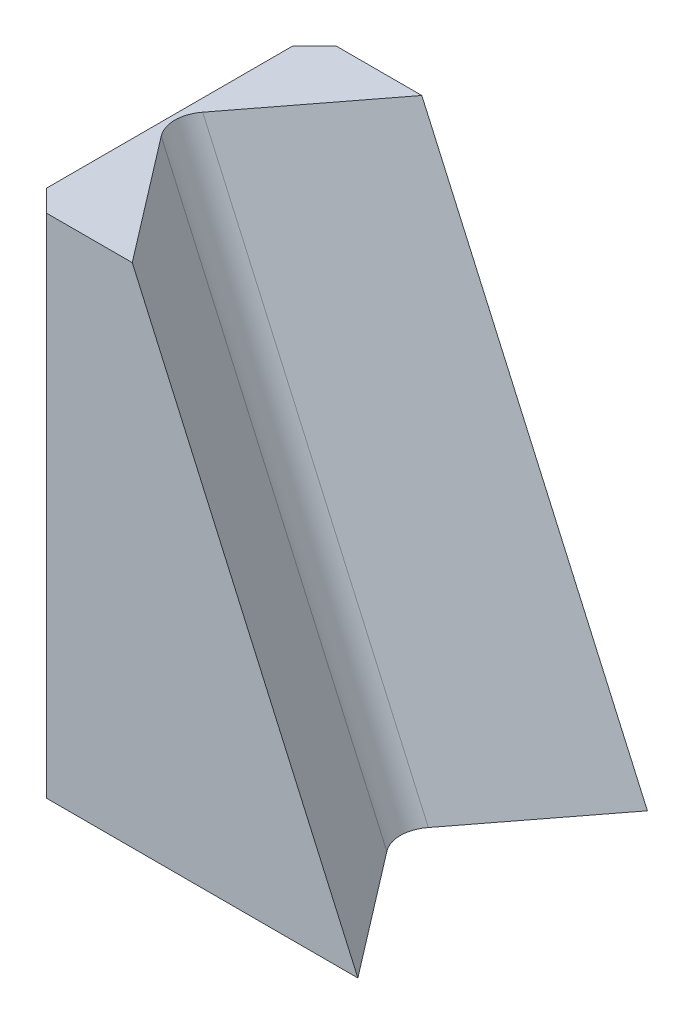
ISO-10303-21;
HEADER;
FILE_DESCRIPTION(('STEP AP214'),'2;1');
FILE_NAME('part.step','',(''),(''),'','','');
FILE_SCHEMA(('AUTOMOTIVE_DESIGN { 1 0 10303 214 1 1 1 1 }'));
ENDSEC;
DATA;
#1=APPLICATION_CONTEXT('core data for automotive mechanical design processes');
#2=APPLICATION_PROTOCOL_DEFINITION('international standard','automotive_design',2000,#1);
#3=PRODUCT_CONTEXT('',#1,'mechanical');
#4=PRODUCT('Part','Part','',(#3));
#5=PRODUCT_RELATED_PRODUCT_CATEGORY('part','',(#4));
#6=PRODUCT_DEFINITION_FORMATION('','',#4);
#7=PRODUCT_DEFINITION_CONTEXT('part definition',#1,'design');
#8=PRODUCT_DEFINITION('design','',#6,#7);
#9=PRODUCT_DEFINITION_SHAPE('','',#8);
#10=(LENGTH_UNIT() NAMED_UNIT(*) SI_UNIT(.MILLI.,.METRE.));
#11=(NAMED_UNIT(*) PLANE_ANGLE_UNIT() SI_UNIT($,.RADIAN.));
#12=(NAMED_UNIT(*) SI_UNIT($,.STERADIAN.) SOLID_ANGLE_UNIT());
#13=UNCERTAINTY_MEASURE_WITH_UNIT(LENGTH_MEASURE(1.E-05),#10,'distance_accuracy_value','');
#14=(GEOMETRIC_REPRESENTATION_CONTEXT(3) GLOBAL_UNCERTAINTY_ASSIGNED_CONTEXT((#13)) GLOBAL_UNIT_ASSIGNED_CONTEXT((#10,
#11,#12)) REPRESENTATION_CONTEXT('',''));
#15=CARTESIAN_POINT('',(0.,0.,0.));
#16=DIRECTION('',(0.,0.,1.));
#17=DIRECTION('',(1.,0.,0.));
#18=AXIS2_PLACEMENT_3D('',#15,#16,#17);
#19=CARTESIAN_POINT('',(1.48339920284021,7.,4.));
#20=DIRECTION('',(0.,-1.,0.));
#21=DIRECTION('',(0.,0.,-1.));
#22=AXIS2_PLACEMENT_3D('',#19,#20,#21);
#23=PLANE('',#22);
#24=DIRECTION('',(-1.,0.,0.));
#25=VECTOR('',#24,1.);
#26=CARTESIAN_POINT('',(1.48339920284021,7.,0.));
#27=LINE('',#26,#25);
#28=CARTESIAN_POINT('',(1.48339920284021,7.,0.));
#29=VERTEX_POINT('',#28);
#30=CARTESIAN_POINT('',(0.3,7.,0.));
#31=VERTEX_POINT('',#30);
#32=EDGE_CURVE('E130',#29,#31,#27,.T.);
#33=ORIENTED_EDGE('',*,*,#32,.T.);
#34=DIRECTION('',(0.70710678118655,0.,-0.707106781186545));
#35=VECTOR('',#34,1.);
#36=CARTESIAN_POINT('',(0.,7.,0.299999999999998));
#37=LINE('',#36,#35);
#38=CARTESIAN_POINT('',(0.,7.,0.299999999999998));
#39=VERTEX_POINT('',#38);
#40=EDGE_CURVE('E56',#31,#39,#37,.F.);
#41=ORIENTED_EDGE('',*,*,#40,.T.);
#42=DIRECTION('',(0.,0.,-1.));
#43=VECTOR('',#42,1.);
#44=CARTESIAN_POINT('',(0.,7.,4.));
#45=LINE('',#44,#43);
#46=CARTESIAN_POINT('',(0.,7.,3.7));
#47=VERTEX_POINT('',#46);
#48=EDGE_CURVE('E156',#47,#39,#45,.T.);
#49=ORIENTED_EDGE('',*,*,#48,.F.);
#50=DIRECTION('',(0.707106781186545,0.,0.70710678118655));
#51=VECTOR('',#50,1.);
#52=CARTESIAN_POINT('',(0.299999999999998,7.,4.));
#53=LINE('',#52,#51);
#54=CARTESIAN_POINT('',(0.299999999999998,7.,4.));
#55=VERTEX_POINT('',#54);
#56=EDGE_CURVE('E63',#47,#55,#53,.T.);
#57=ORIENTED_EDGE('',*,*,#56,.T.);
#58=DIRECTION('',(-1.,0.,0.));
#59=VECTOR('',#58,1.);
#60=CARTESIAN_POINT('',(1.48339920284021,7.,4.));
#61=LINE('',#60,#59);
#62=CARTESIAN_POINT('',(1.48339920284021,7.,4.));
#63=VERTEX_POINT('',#62);
#64=EDGE_CURVE('E127',#63,#55,#61,.T.);
#65=ORIENTED_EDGE('',*,*,#64,.F.);
#66=DIRECTION('',(0.608334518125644,0.,0.793680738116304));
#67=VECTOR('',#66,1.);
#68=CARTESIAN_POINT('',(1.39238296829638,7.,3.88125310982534));
#69=LINE('',#68,#67);
#70=CARTESIAN_POINT('',(0.170269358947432,7.,2.28678821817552));
#71=VERTEX_POINT('',#70);
#72=EDGE_CURVE('E217',#71,#63,#69,.T.);
#73=ORIENTED_EDGE('',*,*,#72,.F.);
#74=CARTESIAN_POINT('',(0.618606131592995,7.,2.));
#75=DIRECTION('',(0.,-1.,0.));
#76=DIRECTION('',(1.,0.,0.));
#77=AXIS2_PLACEMENT_3D('',#74,#75,#76);
#78=ELLIPSE('',#77,0.547318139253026,0.500000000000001);
#79=CARTESIAN_POINT('',(0.170269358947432,7.,1.71321178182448));
#80=VERTEX_POINT('',#79);
#81=EDGE_CURVE('E134',#80,#71,#78,.F.);
#82=ORIENTED_EDGE('',*,*,#81,.F.);
#83=DIRECTION('',(-0.608334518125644,0.,0.793680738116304));
#84=VECTOR('',#83,1.);
#85=CARTESIAN_POINT('',(1.39238296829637,7.,0.118746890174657));
#86=LINE('',#85,#84);
#87=EDGE_CURVE('E122',#29,#80,#86,.T.);
#88=ORIENTED_EDGE('',*,*,#87,.F.);
#89=EDGE_LOOP('',(#33,#41,#49,#57,#65,#73,#82,#88));
#90=FACE_BOUND('',#89,.T.);
#91=ADVANCED_FACE('F46',(#90),#23,.F.);
#92=CARTESIAN_POINT('',(0.,0.,4.));
#93=DIRECTION('',(0.,1.,0.));
#94=DIRECTION('',(0.,0.,1.));
#95=AXIS2_PLACEMENT_3D('',#92,#93,#94);
#96=PLANE('',#95);
#97=DIRECTION('',(0.,0.,-1.));
#98=VECTOR('',#97,1.);
#99=CARTESIAN_POINT('',(0.,0.,4.));
#100=LINE('',#99,#98);
#101=CARTESIAN_POINT('',(0.,0.,3.7));
#102=VERTEX_POINT('',#101);
#103=CARTESIAN_POINT('',(0.,0.,0.299999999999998));
#104=VERTEX_POINT('',#103);
#105=EDGE_CURVE('E152',#102,#104,#100,.T.);
#106=ORIENTED_EDGE('',*,*,#105,.T.);
#107=DIRECTION('',(-0.70710678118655,0.,0.707106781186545));
#108=VECTOR('',#107,1.);
#109=CARTESIAN_POINT('',(0.,0.,0.299999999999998));
#110=LINE('',#109,#108);
#111=CARTESIAN_POINT('',(0.3,0.,0.));
#112=VERTEX_POINT('',#111);
#113=EDGE_CURVE('E170',#104,#112,#110,.F.);
#114=ORIENTED_EDGE('',*,*,#113,.T.);
#115=DIRECTION('',(1.,0.,0.));
#116=VECTOR('',#115,1.);
#117=CARTESIAN_POINT('',(0.,0.,0.));
#118=LINE('',#117,#116);
#119=CARTESIAN_POINT('',(4.6,0.,0.));
#120=VERTEX_POINT('',#119);
#121=EDGE_CURVE('E128',#112,#120,#118,.T.);
#122=ORIENTED_EDGE('',*,*,#121,.T.);
#123=DIRECTION('',(-0.608334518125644,0.,0.793680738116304));
#124=VECTOR('',#123,1.);
#125=CARTESIAN_POINT('',(4.60019873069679,0.,-0.0002592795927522));
#126=LINE('',#125,#124);
#127=CARTESIAN_POINT('',(3.28687015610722,0.,1.71321178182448));
#128=VERTEX_POINT('',#127);
#129=EDGE_CURVE('E125',#120,#128,#126,.T.);
#130=ORIENTED_EDGE('',*,*,#129,.T.);
#131=CARTESIAN_POINT('',(3.73520692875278,0.,2.));
#132=DIRECTION('',(0.,1.,0.));
#133=DIRECTION('',(-1.,0.,0.));
#134=AXIS2_PLACEMENT_3D('',#131,#132,#133);
#135=ELLIPSE('',#134,0.547318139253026,0.500000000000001);
#136=CARTESIAN_POINT('',(3.28687015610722,0.,2.28678821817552));
#137=VERTEX_POINT('',#136);
#138=EDGE_CURVE('E136',#128,#137,#135,.T.);
#139=ORIENTED_EDGE('',*,*,#138,.T.);
#140=DIRECTION('',(0.608334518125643,0.,0.793680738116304));
#141=VECTOR('',#140,1.);
#142=CARTESIAN_POINT('',(4.60019873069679,0.,4.00025927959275));
#143=LINE('',#142,#141);
#144=CARTESIAN_POINT('',(4.6,0.,4.));
#145=VERTEX_POINT('',#144);
#146=EDGE_CURVE('E198',#137,#145,#143,.T.);
#147=ORIENTED_EDGE('',*,*,#146,.T.);
#148=DIRECTION('',(1.,0.,0.));
#149=VECTOR('',#148,1.);
#150=CARTESIAN_POINT('',(0.,0.,4.));
#151=LINE('',#150,#149);
#152=CARTESIAN_POINT('',(0.299999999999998,0.,4.));
#153=VERTEX_POINT('',#152);
#154=EDGE_CURVE('E194',#153,#145,#151,.T.);
#155=ORIENTED_EDGE('',*,*,#154,.F.);
#156=DIRECTION('',(-0.707106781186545,0.,-0.70710678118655));
#157=VECTOR('',#156,1.);
#158=CARTESIAN_POINT('',(0.299999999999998,0.,4.));
#159=LINE('',#158,#157);
#160=EDGE_CURVE('E167',#153,#102,#159,.T.);
#161=ORIENTED_EDGE('',*,*,#160,.T.);
#162=EDGE_LOOP('',(#106,#114,#122,#130,#139,#147,#155,#161));
#163=FACE_BOUND('',#162,.T.);
#164=ADVANCED_FACE('F187',(#163),#96,.F.);
#165=CARTESIAN_POINT('',(0.,7.,4.));
#166=DIRECTION('',(1.,0.,0.));
#167=DIRECTION('',(0.,0.,-1.));
#168=AXIS2_PLACEMENT_3D('',#165,#166,#167);
#169=PLANE('',#168);
#170=ORIENTED_EDGE('',*,*,#48,.T.);
#171=DIRECTION('',(0.,-1.,0.));
#172=VECTOR('',#171,1.);
#173=CARTESIAN_POINT('',(0.,7.,0.299999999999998));
#174=LINE('',#173,#172);
#175=EDGE_CURVE('E163',#39,#104,#174,.T.);
#176=ORIENTED_EDGE('',*,*,#175,.T.);
#177=ORIENTED_EDGE('',*,*,#105,.F.);
#178=DIRECTION('',(0.,1.,0.));
#179=VECTOR('',#178,1.);
#180=CARTESIAN_POINT('',(0.,7.,3.7));
#181=LINE('',#180,#179);
#182=EDGE_CURVE('E160',#102,#47,#181,.T.);
#183=ORIENTED_EDGE('',*,*,#182,.T.);
#184=EDGE_LOOP('',(#170,#176,#177,#183));
#185=FACE_BOUND('',#184,.T.);
#186=ADVANCED_FACE('F182',(#185),#169,.F.);
#187=CARTESIAN_POINT('',(0.,0.,4.));
#188=DIRECTION('',(0.,0.,1.));
#189=DIRECTION('',(1.,0.,0.));
#190=AXIS2_PLACEMENT_3D('',#187,#188,#189);
#191=PLANE('',#190);
#192=ORIENTED_EDGE('',*,*,#64,.T.);
#193=DIRECTION('',(0.,-1.,0.));
#194=VECTOR('',#193,1.);
#195=CARTESIAN_POINT('',(0.299999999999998,0.,4.));
#196=LINE('',#195,#194);
#197=EDGE_CURVE('E11',#55,#153,#196,.T.);
#198=ORIENTED_EDGE('',*,*,#197,.T.);
#199=ORIENTED_EDGE('',*,*,#154,.T.);
#200=DIRECTION('',(-0.406736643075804,0.913545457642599,0.));
#201=VECTOR('',#200,1.);
#202=CARTESIAN_POINT('',(4.6,0.,4.));
#203=LINE('',#202,#201);
#204=EDGE_CURVE('E149',#145,#63,#203,.T.);
#205=ORIENTED_EDGE('',*,*,#204,.T.);
#206=EDGE_LOOP('',(#192,#198,#199,#205));
#207=FACE_BOUND('',#206,.T.);
#208=ADVANCED_FACE('F192',(#207),#191,.T.);
#209=CARTESIAN_POINT('',(0.,0.,0.));
#210=DIRECTION('',(0.,0.,1.));
#211=DIRECTION('',(1.,0.,0.));
#212=AXIS2_PLACEMENT_3D('',#209,#210,#211);
#213=PLANE('',#212);
#214=ORIENTED_EDGE('',*,*,#121,.F.);
#215=DIRECTION('',(0.,1.,0.));
#216=VECTOR('',#215,1.);
#217=CARTESIAN_POINT('',(0.3,0.,0.));
#218=LINE('',#217,#216);
#219=EDGE_CURVE('E71',#112,#31,#218,.T.);
#220=ORIENTED_EDGE('',*,*,#219,.T.);
#221=ORIENTED_EDGE('',*,*,#32,.F.);
#222=DIRECTION('',(-0.406736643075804,0.913545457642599,0.));
#223=VECTOR('',#222,1.);
#224=CARTESIAN_POINT('',(4.6,0.,0.));
#225=LINE('',#224,#223);
#226=EDGE_CURVE('E118',#120,#29,#225,.T.);
#227=ORIENTED_EDGE('',*,*,#226,.F.);
#228=EDGE_LOOP('',(#214,#220,#221,#227));
#229=FACE_BOUND('',#228,.T.);
#230=ADVANCED_FACE('F138',(#229),#213,.F.);
#231=CARTESIAN_POINT('',(4.60053700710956,-0.00120613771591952,4.));
#232=DIRECTION('',(0.748332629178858,0.333179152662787,-0.573576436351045));
#233=DIRECTION('',(-0.608334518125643,0.,-0.793680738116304));
#234=AXIS2_PLACEMENT_3D('',#231,#232,#233);
#235=PLANE('',#234);
#236=DIRECTION('',(-0.406736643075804,0.913545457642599,0.));
#237=VECTOR('',#236,1.);
#238=CARTESIAN_POINT('',(3.50464440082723,-0.489128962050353,2.28678821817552));
#239=LINE('',#238,#237);
#240=EDGE_CURVE('E146',#137,#71,#239,.T.);
#241=ORIENTED_EDGE('',*,*,#240,.T.);
#242=ORIENTED_EDGE('',*,*,#72,.T.);
#243=ORIENTED_EDGE('',*,*,#204,.F.);
#244=ORIENTED_EDGE('',*,*,#146,.F.);
#245=EDGE_LOOP('',(#241,#242,#243,#244));
#246=FACE_BOUND('',#245,.T.);
#247=ADVANCED_FACE('F222',(#246),#235,.T.);
#248=CARTESIAN_POINT('',(3.87881071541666,-0.322539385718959,2.));
#249=DIRECTION('',(-0.406736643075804,0.913545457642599,0.));
#250=DIRECTION('',(-0.913545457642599,-0.406736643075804,0.));
#251=AXIS2_PLACEMENT_3D('',#248,#249,#250);
#252=CYLINDRICAL_SURFACE('',#251,0.500000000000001);
#253=DIRECTION('',(-0.406736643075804,0.913545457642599,0.));
#254=VECTOR('',#253,1.);
#255=CARTESIAN_POINT('',(3.50464440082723,-0.489128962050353,1.71321178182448));
#256=LINE('',#255,#254);
#257=EDGE_CURVE('E208',#128,#80,#256,.T.);
#258=ORIENTED_EDGE('',*,*,#257,.T.);
#259=ORIENTED_EDGE('',*,*,#81,.T.);
#260=ORIENTED_EDGE('',*,*,#240,.F.);
#261=ORIENTED_EDGE('',*,*,#138,.F.);
#262=EDGE_LOOP('',(#258,#259,#260,#261));
#263=FACE_BOUND('',#262,.T.);
#264=ADVANCED_FACE('F225',(#263),#252,.F.);
#265=CARTESIAN_POINT('',(4.60053700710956,-0.00120613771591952,0.));
#266=DIRECTION('',(0.748332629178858,0.333179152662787,0.573576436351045));
#267=DIRECTION('',(0.608334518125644,0.,-0.793680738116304));
#268=AXIS2_PLACEMENT_3D('',#265,#266,#267);
#269=PLANE('',#268);
#270=ORIENTED_EDGE('',*,*,#226,.T.);
#271=ORIENTED_EDGE('',*,*,#87,.T.);
#272=ORIENTED_EDGE('',*,*,#257,.F.);
#273=ORIENTED_EDGE('',*,*,#129,.F.);
#274=EDGE_LOOP('',(#270,#271,#272,#273));
#275=FACE_BOUND('',#274,.T.);
#276=ADVANCED_FACE('F120',(#275),#269,.T.);
#277=CARTESIAN_POINT('',(0.,7.,0.299999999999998));
#278=DIRECTION('',(0.707106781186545,0.,0.70710678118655));
#279=DIRECTION('',(0.,-1.,0.));
#280=AXIS2_PLACEMENT_3D('',#277,#278,#279);
#281=PLANE('',#280);
#282=ORIENTED_EDGE('',*,*,#40,.F.);
#283=ORIENTED_EDGE('',*,*,#219,.F.);
#284=ORIENTED_EDGE('',*,*,#113,.F.);
#285=ORIENTED_EDGE('',*,*,#175,.F.);
#286=EDGE_LOOP('',(#282,#283,#284,#285));
#287=FACE_BOUND('',#286,.T.);
#288=ADVANCED_FACE('F185',(#287),#281,.F.);
#289=CARTESIAN_POINT('',(0.299999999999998,0.,4.));
#290=DIRECTION('',(-0.70710678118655,0.,0.707106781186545));
#291=DIRECTION('',(0.,1.,0.));
#292=AXIS2_PLACEMENT_3D('',#289,#290,#291);
#293=PLANE('',#292);
#294=ORIENTED_EDGE('',*,*,#56,.F.);
#295=ORIENTED_EDGE('',*,*,#182,.F.);
#296=ORIENTED_EDGE('',*,*,#160,.F.);
#297=ORIENTED_EDGE('',*,*,#197,.F.);
#298=EDGE_LOOP('',(#294,#295,#296,#297));
#299=FACE_BOUND('',#298,.T.);
#300=ADVANCED_FACE('F49',(#299),#293,.T.);
#301=CLOSED_SHELL('',(#91,#164,#186,#208,#230,#247,#264,#276,#288,#300));
#302=MANIFOLD_SOLID_BREP('B2',#301);
#303=ADVANCED_BREP_SHAPE_REPRESENTATION('',(#18,#302),#14);
#304=SHAPE_DEFINITION_REPRESENTATION(#9,#303);
ENDSEC;
END-ISO-10303-21;
